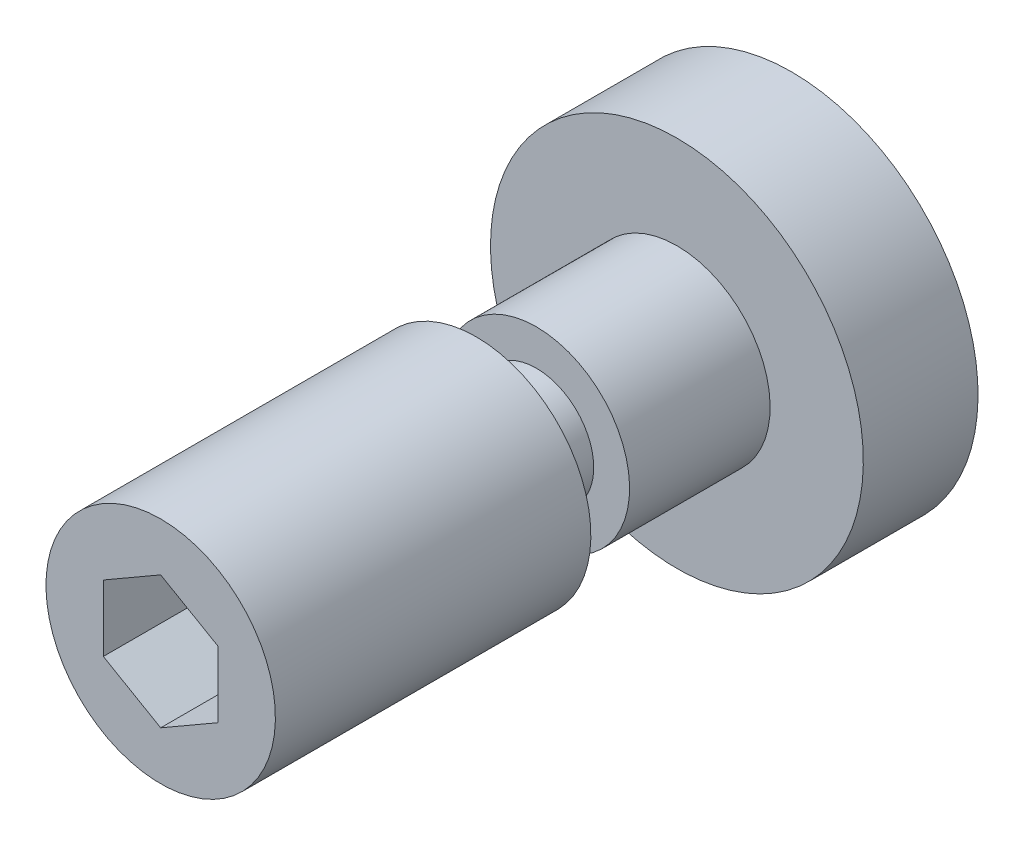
ISO-10303-21;
HEADER;
FILE_DESCRIPTION(('STEP AP214'),'2;1');
FILE_NAME('part.step','',(''),(''),'','','');
FILE_SCHEMA(('AUTOMOTIVE_DESIGN { 1 0 10303 214 1 1 1 1 }'));
ENDSEC;
DATA;
#1=APPLICATION_CONTEXT('core data for automotive mechanical design processes');
#2=APPLICATION_PROTOCOL_DEFINITION('international standard','automotive_design',2000,#1);
#3=PRODUCT_CONTEXT('',#1,'mechanical');
#4=PRODUCT('Part','Part','',(#3));
#5=PRODUCT_RELATED_PRODUCT_CATEGORY('part','',(#4));
#6=PRODUCT_DEFINITION_FORMATION('','',#4);
#7=PRODUCT_DEFINITION_CONTEXT('part definition',#1,'design');
#8=PRODUCT_DEFINITION('design','',#6,#7);
#9=PRODUCT_DEFINITION_SHAPE('','',#8);
#10=(LENGTH_UNIT() NAMED_UNIT(*) SI_UNIT(.MILLI.,.METRE.));
#11=(NAMED_UNIT(*) PLANE_ANGLE_UNIT() SI_UNIT($,.RADIAN.));
#12=(NAMED_UNIT(*) SI_UNIT($,.STERADIAN.) SOLID_ANGLE_UNIT());
#13=UNCERTAINTY_MEASURE_WITH_UNIT(LENGTH_MEASURE(1.E-05),#10,'distance_accuracy_value','');
#14=(GEOMETRIC_REPRESENTATION_CONTEXT(3) GLOBAL_UNCERTAINTY_ASSIGNED_CONTEXT((#13)) GLOBAL_UNIT_ASSIGNED_CONTEXT((#10,
#11,#12)) REPRESENTATION_CONTEXT('',''));
#15=CARTESIAN_POINT('',(0.,0.,0.));
#16=DIRECTION('',(0.,0.,1.));
#17=DIRECTION('',(1.,0.,0.));
#18=AXIS2_PLACEMENT_3D('',#15,#16,#17);
#19=CARTESIAN_POINT('',(0.,0.,0.));
#20=DIRECTION('',(0.,0.,1.));
#21=DIRECTION('',(0.,1.,0.));
#22=AXIS2_PLACEMENT_3D('',#19,#20,#21);
#23=PLANE('',#22);
#24=CARTESIAN_POINT('',(0.,0.,0.));
#25=DIRECTION('',(0.,0.,1.));
#26=DIRECTION('',(0.,1.,0.));
#27=AXIS2_PLACEMENT_3D('',#24,#25,#26);
#28=CIRCLE('',#27,6.5);
#29=CARTESIAN_POINT('',(0.,6.5,0.));
#30=VERTEX_POINT('',#29);
#31=EDGE_CURVE('E9',#30,#30,#28,.T.);
#32=ORIENTED_EDGE('',*,*,#31,.F.);
#33=EDGE_LOOP('',(#32));
#34=FACE_BOUND('',#33,.T.);
#35=ADVANCED_FACE('F14',(#34),#23,.F.);
#36=CARTESIAN_POINT('',(0.,0.,40.));
#37=DIRECTION('',(0.,0.,1.));
#38=DIRECTION('',(0.,1.,0.));
#39=AXIS2_PLACEMENT_3D('',#36,#37,#38);
#40=CYLINDRICAL_SURFACE('',#39,6.5);
#41=CARTESIAN_POINT('',(0.,0.,4.));
#42=DIRECTION('',(0.,0.,1.));
#43=DIRECTION('',(0.,1.,0.));
#44=AXIS2_PLACEMENT_3D('',#41,#42,#43);
#45=CIRCLE('',#44,6.5);
#46=CARTESIAN_POINT('',(0.,6.5,4.));
#47=VERTEX_POINT('',#46);
#48=EDGE_CURVE('E21',#47,#47,#45,.T.);
#49=ORIENTED_EDGE('',*,*,#48,.F.);
#50=EDGE_LOOP('',(#49));
#51=FACE_BOUND('',#50,.T.);
#52=ORIENTED_EDGE('',*,*,#31,.T.);
#53=EDGE_LOOP('',(#52));
#54=FACE_BOUND('',#53,.T.);
#55=ADVANCED_FACE('F142',(#51,#54),#40,.T.);
#56=CARTESIAN_POINT('',(0.,-6.5,4.));
#57=DIRECTION('',(0.,0.,-1.));
#58=DIRECTION('',(0.,-1.,0.));
#59=AXIS2_PLACEMENT_3D('',#56,#57,#58);
#60=PLANE('',#59);
#61=CARTESIAN_POINT('',(0.,0.,4.));
#62=DIRECTION('',(0.,0.,1.));
#63=DIRECTION('',(0.,1.,0.));
#64=AXIS2_PLACEMENT_3D('',#61,#62,#63);
#65=CIRCLE('',#64,3.25);
#66=CARTESIAN_POINT('',(0.,3.25,4.));
#67=VERTEX_POINT('',#66);
#68=EDGE_CURVE('E135',#67,#67,#65,.T.);
#69=ORIENTED_EDGE('',*,*,#68,.F.);
#70=EDGE_LOOP('',(#69));
#71=FACE_BOUND('',#70,.T.);
#72=ORIENTED_EDGE('',*,*,#48,.T.);
#73=EDGE_LOOP('',(#72));
#74=FACE_BOUND('',#73,.T.);
#75=ADVANCED_FACE('F140',(#71,#74),#60,.F.);
#76=CARTESIAN_POINT('',(0.,0.,40.));
#77=DIRECTION('',(0.,0.,1.));
#78=DIRECTION('',(0.,1.,0.));
#79=AXIS2_PLACEMENT_3D('',#76,#77,#78);
#80=CYLINDRICAL_SURFACE('',#79,3.25);
#81=CARTESIAN_POINT('',(0.,0.,8.9));
#82=DIRECTION('',(0.,0.,1.));
#83=DIRECTION('',(0.,1.,0.));
#84=AXIS2_PLACEMENT_3D('',#81,#82,#83);
#85=CIRCLE('',#84,3.25);
#86=CARTESIAN_POINT('',(0.,3.25,8.9));
#87=VERTEX_POINT('',#86);
#88=EDGE_CURVE('E132',#87,#87,#85,.T.);
#89=ORIENTED_EDGE('',*,*,#88,.F.);
#90=EDGE_LOOP('',(#89));
#91=FACE_BOUND('',#90,.T.);
#92=ORIENTED_EDGE('',*,*,#68,.T.);
#93=EDGE_LOOP('',(#92));
#94=FACE_BOUND('',#93,.T.);
#95=ADVANCED_FACE('F165',(#91,#94),#80,.T.);
#96=CARTESIAN_POINT('',(0.,-3.25,8.9));
#97=DIRECTION('',(0.,0.,-1.));
#98=DIRECTION('',(0.,-1.,0.));
#99=AXIS2_PLACEMENT_3D('',#96,#97,#98);
#100=PLANE('',#99);
#101=CARTESIAN_POINT('',(0.,0.,8.9));
#102=DIRECTION('',(0.,0.,1.));
#103=DIRECTION('',(0.,1.,0.));
#104=AXIS2_PLACEMENT_3D('',#101,#102,#103);
#105=CIRCLE('',#104,2.);
#106=CARTESIAN_POINT('',(0.,2.,8.9));
#107=VERTEX_POINT('',#106);
#108=EDGE_CURVE('E129',#107,#107,#105,.T.);
#109=ORIENTED_EDGE('',*,*,#108,.F.);
#110=EDGE_LOOP('',(#109));
#111=FACE_BOUND('',#110,.T.);
#112=ORIENTED_EDGE('',*,*,#88,.T.);
#113=EDGE_LOOP('',(#112));
#114=FACE_BOUND('',#113,.T.);
#115=ADVANCED_FACE('F174',(#111,#114),#100,.F.);
#116=CARTESIAN_POINT('',(0.,0.,40.));
#117=DIRECTION('',(0.,0.,1.));
#118=DIRECTION('',(0.,1.,0.));
#119=AXIS2_PLACEMENT_3D('',#116,#117,#118);
#120=CYLINDRICAL_SURFACE('',#119,2.);
#121=CARTESIAN_POINT('',(0.,0.,11.));
#122=DIRECTION('',(0.,0.,1.));
#123=DIRECTION('',(0.,1.,0.));
#124=AXIS2_PLACEMENT_3D('',#121,#122,#123);
#125=CIRCLE('',#124,2.);
#126=CARTESIAN_POINT('',(0.,2.,11.));
#127=VERTEX_POINT('',#126);
#128=EDGE_CURVE('E126',#127,#127,#125,.T.);
#129=ORIENTED_EDGE('',*,*,#128,.F.);
#130=EDGE_LOOP('',(#129));
#131=FACE_BOUND('',#130,.T.);
#132=ORIENTED_EDGE('',*,*,#108,.T.);
#133=EDGE_LOOP('',(#132));
#134=FACE_BOUND('',#133,.T.);
#135=ADVANCED_FACE('F183',(#131,#134),#120,.T.);
#136=CARTESIAN_POINT('',(0.,-2.,11.));
#137=DIRECTION('',(0.,0.,1.));
#138=DIRECTION('',(0.,1.,0.));
#139=AXIS2_PLACEMENT_3D('',#136,#137,#138);
#140=PLANE('',#139);
#141=CARTESIAN_POINT('',(0.,0.,11.));
#142=DIRECTION('',(0.,0.,1.));
#143=DIRECTION('',(0.,1.,0.));
#144=AXIS2_PLACEMENT_3D('',#141,#142,#143);
#145=CIRCLE('',#144,4.);
#146=CARTESIAN_POINT('',(0.,4.,11.));
#147=VERTEX_POINT('',#146);
#148=EDGE_CURVE('E123',#147,#147,#145,.T.);
#149=ORIENTED_EDGE('',*,*,#148,.F.);
#150=EDGE_LOOP('',(#149));
#151=FACE_BOUND('',#150,.T.);
#152=ORIENTED_EDGE('',*,*,#128,.T.);
#153=EDGE_LOOP('',(#152));
#154=FACE_BOUND('',#153,.T.);
#155=ADVANCED_FACE('F192',(#151,#154),#140,.F.);
#156=CARTESIAN_POINT('',(0.,0.,40.));
#157=DIRECTION('',(0.,0.,1.));
#158=DIRECTION('',(0.,1.,0.));
#159=AXIS2_PLACEMENT_3D('',#156,#157,#158);
#160=CYLINDRICAL_SURFACE('',#159,4.);
#161=CARTESIAN_POINT('',(0.,0.,22.));
#162=DIRECTION('',(0.,0.,1.));
#163=DIRECTION('',(0.,1.,0.));
#164=AXIS2_PLACEMENT_3D('',#161,#162,#163);
#165=CIRCLE('',#164,4.);
#166=CARTESIAN_POINT('',(0.,4.,22.));
#167=VERTEX_POINT('',#166);
#168=EDGE_CURVE('E115',#167,#167,#165,.T.);
#169=ORIENTED_EDGE('',*,*,#168,.F.);
#170=EDGE_LOOP('',(#169));
#171=FACE_BOUND('',#170,.T.);
#172=ORIENTED_EDGE('',*,*,#148,.T.);
#173=EDGE_LOOP('',(#172));
#174=FACE_BOUND('',#173,.T.);
#175=ADVANCED_FACE('F201',(#171,#174),#160,.T.);
#176=CARTESIAN_POINT('',(0.,-4.,22.));
#177=DIRECTION('',(0.,0.,-1.));
#178=DIRECTION('',(0.,-1.,0.));
#179=AXIS2_PLACEMENT_3D('',#176,#177,#178);
#180=PLANE('',#179);
#181=DIRECTION('',(-0.866025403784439,-0.5,0.));
#182=VECTOR('',#181,1.);
#183=CARTESIAN_POINT('',(0.,2.30940107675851,22.));
#184=LINE('',#183,#182);
#185=CARTESIAN_POINT('',(0.,2.30940107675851,22.));
#186=VERTEX_POINT('',#185);
#187=CARTESIAN_POINT('',(-2.,1.15470053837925,22.));
#188=VERTEX_POINT('',#187);
#189=EDGE_CURVE('E102',#186,#188,#184,.T.);
#190=ORIENTED_EDGE('',*,*,#189,.F.);
#191=DIRECTION('',(-0.866025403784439,0.5,0.));
#192=VECTOR('',#191,1.);
#193=CARTESIAN_POINT('',(2.,1.15470053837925,22.));
#194=LINE('',#193,#192);
#195=CARTESIAN_POINT('',(2.,1.15470053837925,22.));
#196=VERTEX_POINT('',#195);
#197=EDGE_CURVE('E28',#196,#186,#194,.T.);
#198=ORIENTED_EDGE('',*,*,#197,.F.);
#199=DIRECTION('',(0.,1.,0.));
#200=VECTOR('',#199,1.);
#201=CARTESIAN_POINT('',(2.,-1.15470053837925,22.));
#202=LINE('',#201,#200);
#203=CARTESIAN_POINT('',(2.,-1.15470053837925,22.));
#204=VERTEX_POINT('',#203);
#205=EDGE_CURVE('E111',#204,#196,#202,.T.);
#206=ORIENTED_EDGE('',*,*,#205,.F.);
#207=DIRECTION('',(0.866025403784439,0.5,0.));
#208=VECTOR('',#207,1.);
#209=CARTESIAN_POINT('',(0.,-2.30940107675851,22.));
#210=LINE('',#209,#208);
#211=CARTESIAN_POINT('',(0.,-2.30940107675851,22.));
#212=VERTEX_POINT('',#211);
#213=EDGE_CURVE('E109',#212,#204,#210,.T.);
#214=ORIENTED_EDGE('',*,*,#213,.F.);
#215=DIRECTION('',(0.866025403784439,-0.5,0.));
#216=VECTOR('',#215,1.);
#217=CARTESIAN_POINT('',(-2.,-1.15470053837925,22.));
#218=LINE('',#217,#216);
#219=CARTESIAN_POINT('',(-2.,-1.15470053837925,22.));
#220=VERTEX_POINT('',#219);
#221=EDGE_CURVE('E76',#220,#212,#218,.T.);
#222=ORIENTED_EDGE('',*,*,#221,.F.);
#223=DIRECTION('',(0.,-1.,0.));
#224=VECTOR('',#223,1.);
#225=CARTESIAN_POINT('',(-2.,1.15470053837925,22.));
#226=LINE('',#225,#224);
#227=EDGE_CURVE('E105',#188,#220,#226,.T.);
#228=ORIENTED_EDGE('',*,*,#227,.F.);
#229=EDGE_LOOP('',(#190,#198,#206,#214,#222,#228));
#230=FACE_BOUND('',#229,.T.);
#231=ORIENTED_EDGE('',*,*,#168,.T.);
#232=EDGE_LOOP('',(#231));
#233=FACE_BOUND('',#232,.T.);
#234=ADVANCED_FACE('F210',(#230,#233),#180,.F.);
#235=CARTESIAN_POINT('',(2.,1.15470053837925,17.));
#236=DIRECTION('',(0.5,0.866025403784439,0.));
#237=DIRECTION('',(-0.866025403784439,0.5,0.));
#238=AXIS2_PLACEMENT_3D('',#235,#236,#237);
#239=PLANE('',#238);
#240=ORIENTED_EDGE('',*,*,#197,.T.);
#241=DIRECTION('',(0.,0.,1.));
#242=VECTOR('',#241,1.);
#243=CARTESIAN_POINT('',(0.,2.30940107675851,17.));
#244=LINE('',#243,#242);
#245=CARTESIAN_POINT('',(0.,2.30940107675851,17.));
#246=VERTEX_POINT('',#245);
#247=EDGE_CURVE('E58',#246,#186,#244,.T.);
#248=ORIENTED_EDGE('',*,*,#247,.F.);
#249=DIRECTION('',(-0.866025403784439,0.5,0.));
#250=VECTOR('',#249,1.);
#251=CARTESIAN_POINT('',(2.,1.15470053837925,17.));
#252=LINE('',#251,#250);
#253=CARTESIAN_POINT('',(2.,1.15470053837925,17.));
#254=VERTEX_POINT('',#253);
#255=EDGE_CURVE('E113',#254,#246,#252,.T.);
#256=ORIENTED_EDGE('',*,*,#255,.F.);
#257=DIRECTION('',(0.,0.,1.));
#258=VECTOR('',#257,1.);
#259=CARTESIAN_POINT('',(2.,1.15470053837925,17.));
#260=LINE('',#259,#258);
#261=EDGE_CURVE('E36',#254,#196,#260,.T.);
#262=ORIENTED_EDGE('',*,*,#261,.T.);
#263=EDGE_LOOP('',(#240,#248,#256,#262));
#264=FACE_BOUND('',#263,.T.);
#265=ADVANCED_FACE('F219',(#264),#239,.F.);
#266=CARTESIAN_POINT('',(2.,-1.15470053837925,17.));
#267=DIRECTION('',(1.,0.,0.));
#268=DIRECTION('',(0.,0.,-1.));
#269=AXIS2_PLACEMENT_3D('',#266,#267,#268);
#270=PLANE('',#269);
#271=ORIENTED_EDGE('',*,*,#205,.T.);
#272=ORIENTED_EDGE('',*,*,#261,.F.);
#273=DIRECTION('',(0.,1.,0.));
#274=VECTOR('',#273,1.);
#275=CARTESIAN_POINT('',(2.,-1.15470053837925,17.));
#276=LINE('',#275,#274);
#277=CARTESIAN_POINT('',(2.,-1.15470053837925,17.));
#278=VERTEX_POINT('',#277);
#279=EDGE_CURVE('E88',#278,#254,#276,.T.);
#280=ORIENTED_EDGE('',*,*,#279,.F.);
#281=DIRECTION('',(0.,0.,1.));
#282=VECTOR('',#281,1.);
#283=CARTESIAN_POINT('',(2.,-1.15470053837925,17.));
#284=LINE('',#283,#282);
#285=EDGE_CURVE('E80',#278,#204,#284,.T.);
#286=ORIENTED_EDGE('',*,*,#285,.T.);
#287=EDGE_LOOP('',(#271,#272,#280,#286));
#288=FACE_BOUND('',#287,.T.);
#289=ADVANCED_FACE('F228',(#288),#270,.F.);
#290=CARTESIAN_POINT('',(0.,-2.30940107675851,17.));
#291=DIRECTION('',(0.5,-0.866025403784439,0.));
#292=DIRECTION('',(0.866025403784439,0.5,0.));
#293=AXIS2_PLACEMENT_3D('',#290,#291,#292);
#294=PLANE('',#293);
#295=ORIENTED_EDGE('',*,*,#213,.T.);
#296=ORIENTED_EDGE('',*,*,#285,.F.);
#297=DIRECTION('',(0.866025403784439,0.5,0.));
#298=VECTOR('',#297,1.);
#299=CARTESIAN_POINT('',(0.,-2.30940107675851,17.));
#300=LINE('',#299,#298);
#301=CARTESIAN_POINT('',(0.,-2.30940107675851,17.));
#302=VERTEX_POINT('',#301);
#303=EDGE_CURVE('E84',#302,#278,#300,.T.);
#304=ORIENTED_EDGE('',*,*,#303,.F.);
#305=DIRECTION('',(0.,0.,1.));
#306=VECTOR('',#305,1.);
#307=CARTESIAN_POINT('',(0.,-2.30940107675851,17.));
#308=LINE('',#307,#306);
#309=EDGE_CURVE('E69',#302,#212,#308,.T.);
#310=ORIENTED_EDGE('',*,*,#309,.T.);
#311=EDGE_LOOP('',(#295,#296,#304,#310));
#312=FACE_BOUND('',#311,.T.);
#313=ADVANCED_FACE('F85',(#312),#294,.F.);
#314=CARTESIAN_POINT('',(-2.,-1.15470053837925,17.));
#315=DIRECTION('',(-0.5,-0.866025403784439,0.));
#316=DIRECTION('',(0.866025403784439,-0.5,0.));
#317=AXIS2_PLACEMENT_3D('',#314,#315,#316);
#318=PLANE('',#317);
#319=ORIENTED_EDGE('',*,*,#221,.T.);
#320=ORIENTED_EDGE('',*,*,#309,.F.);
#321=DIRECTION('',(0.866025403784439,-0.5,0.));
#322=VECTOR('',#321,1.);
#323=CARTESIAN_POINT('',(-2.,-1.15470053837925,17.));
#324=LINE('',#323,#322);
#325=CARTESIAN_POINT('',(-2.,-1.15470053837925,17.));
#326=VERTEX_POINT('',#325);
#327=EDGE_CURVE('E73',#326,#302,#324,.T.);
#328=ORIENTED_EDGE('',*,*,#327,.F.);
#329=DIRECTION('',(0.,0.,1.));
#330=VECTOR('',#329,1.);
#331=CARTESIAN_POINT('',(-2.,-1.15470053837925,17.));
#332=LINE('',#331,#330);
#333=EDGE_CURVE('E81',#326,#220,#332,.T.);
#334=ORIENTED_EDGE('',*,*,#333,.T.);
#335=EDGE_LOOP('',(#319,#320,#328,#334));
#336=FACE_BOUND('',#335,.T.);
#337=ADVANCED_FACE('F71',(#336),#318,.F.);
#338=CARTESIAN_POINT('',(-2.,1.15470053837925,17.));
#339=DIRECTION('',(-1.,0.,0.));
#340=DIRECTION('',(0.,-1.,0.));
#341=AXIS2_PLACEMENT_3D('',#338,#339,#340);
#342=PLANE('',#341);
#343=ORIENTED_EDGE('',*,*,#227,.T.);
#344=ORIENTED_EDGE('',*,*,#333,.F.);
#345=DIRECTION('',(0.,-1.,0.));
#346=VECTOR('',#345,1.);
#347=CARTESIAN_POINT('',(-2.,1.15470053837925,17.));
#348=LINE('',#347,#346);
#349=CARTESIAN_POINT('',(-2.,1.15470053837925,17.));
#350=VERTEX_POINT('',#349);
#351=EDGE_CURVE('E94',#350,#326,#348,.T.);
#352=ORIENTED_EDGE('',*,*,#351,.F.);
#353=DIRECTION('',(0.,0.,1.));
#354=VECTOR('',#353,1.);
#355=CARTESIAN_POINT('',(-2.,1.15470053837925,17.));
#356=LINE('',#355,#354);
#357=EDGE_CURVE('E118',#350,#188,#356,.T.);
#358=ORIENTED_EDGE('',*,*,#357,.T.);
#359=EDGE_LOOP('',(#343,#344,#352,#358));
#360=FACE_BOUND('',#359,.T.);
#361=ADVANCED_FACE('F250',(#360),#342,.F.);
#362=CARTESIAN_POINT('',(0.,2.30940107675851,17.));
#363=DIRECTION('',(-0.5,0.866025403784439,0.));
#364=DIRECTION('',(-0.866025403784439,-0.5,0.));
#365=AXIS2_PLACEMENT_3D('',#362,#363,#364);
#366=PLANE('',#365);
#367=ORIENTED_EDGE('',*,*,#189,.T.);
#368=ORIENTED_EDGE('',*,*,#357,.F.);
#369=DIRECTION('',(-0.866025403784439,-0.5,0.));
#370=VECTOR('',#369,1.);
#371=CARTESIAN_POINT('',(0.,2.30940107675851,17.));
#372=LINE('',#371,#370);
#373=EDGE_CURVE('E96',#246,#350,#372,.T.);
#374=ORIENTED_EDGE('',*,*,#373,.F.);
#375=ORIENTED_EDGE('',*,*,#247,.T.);
#376=EDGE_LOOP('',(#367,#368,#374,#375));
#377=FACE_BOUND('',#376,.T.);
#378=ADVANCED_FACE('F258',(#377),#366,.F.);
#379=CARTESIAN_POINT('',(0.,2.30940107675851,17.));
#380=DIRECTION('',(0.,0.,1.));
#381=DIRECTION('',(1.,0.,0.));
#382=AXIS2_PLACEMENT_3D('',#379,#380,#381);
#383=PLANE('',#382);
#384=ORIENTED_EDGE('',*,*,#255,.T.);
#385=ORIENTED_EDGE('',*,*,#373,.T.);
#386=ORIENTED_EDGE('',*,*,#351,.T.);
#387=ORIENTED_EDGE('',*,*,#327,.T.);
#388=ORIENTED_EDGE('',*,*,#303,.T.);
#389=ORIENTED_EDGE('',*,*,#279,.T.);
#390=EDGE_LOOP('',(#384,#385,#386,#387,#388,#389));
#391=FACE_BOUND('',#390,.T.);
#392=ADVANCED_FACE('F91',(#391),#383,.T.);
#393=CLOSED_SHELL('',(#35,#55,#75,#95,#115,#135,#155,#175,#234,#265,#289,#313,#337,#361,#378,#392));
#394=MANIFOLD_SOLID_BREP('B1',#393);
#395=ADVANCED_BREP_SHAPE_REPRESENTATION('',(#18,#394),#14);
#396=SHAPE_DEFINITION_REPRESENTATION(#9,#395);
ENDSEC;
END-ISO-10303-21;
